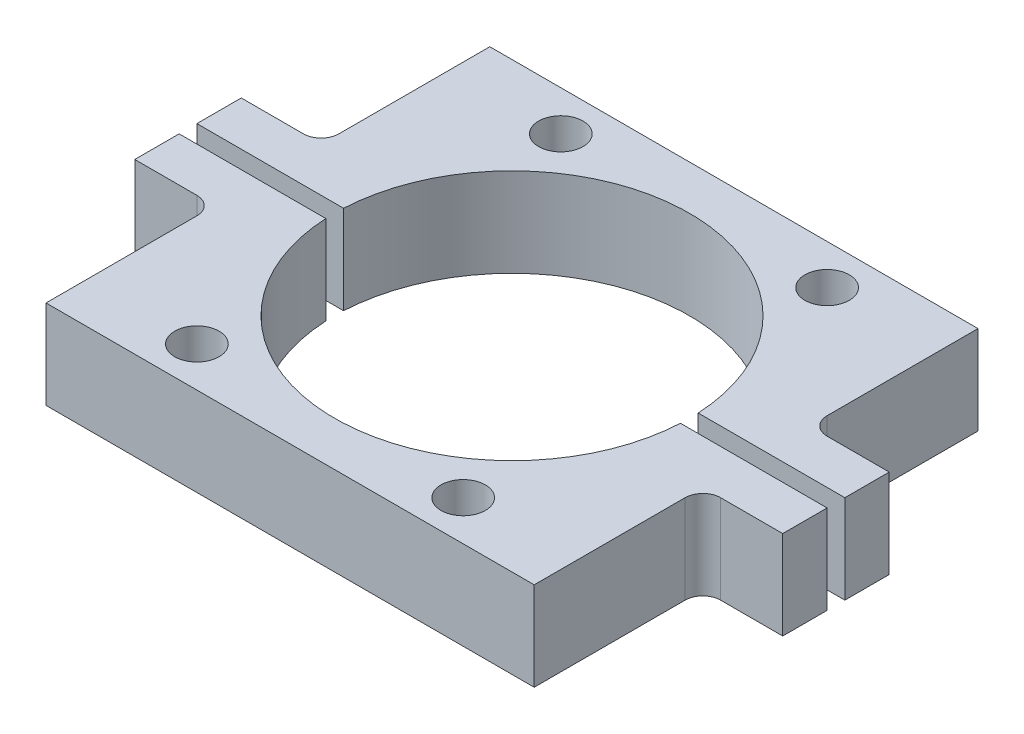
from build123d import *

# Parameters (mm, degrees)
BOSS_EXTRUDE1_DEPTH   = 20
BOSS_EXTRUDE1_2_DEPTH = 20
SKETCH2_R             = 5
CUT_EXTRUDE2_DEPTH    = 20
FILLET1_R             = 4
FILLET2_R             = 4


with BuildPart() as part:
    # Sketch1 → Boss-Extrude1 (new body)
    with BuildSketch(Plane(origin=(0, 0, 0), x_dir=(1, 0, 0), z_dir=(0, 1, 0))):
        with BuildLine():
            Line((-73, -2), (-73, -12))
            Line((-73, -12), (-55, -12))
            Line((-55, -12), (-55, -50))
            Line((-55, -50), (55, -50))
            Line((55, -50), (55, -12))
            Line((55, -12), (73, -12))
            Line((73, -12), (73, -2))
            Line((73, -2), (39.949968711, -2))
            ThreePointArc((39.949968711, -2), (0, -40), (-39.949968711, -2))
            Line((-39.949968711, -2), (-73, -2))
        make_face()
    extrude(amount=BOSS_EXTRUDE1_DEPTH)


with BuildPart() as body_2:
    # Sketch1 → Boss-Extrude1 2 (new body)
    with BuildSketch(Plane(origin=(0, 0, 0), x_dir=(1, 0, 0), z_dir=(0, 1, 0))):
        with BuildLine():
            Line((55, 50), (-55, 50))
            Line((-55, 50), (-55, 12))
            Line((-55, 12), (-73, 12))
            Line((-73, 12), (-73, 2))
            Line((-73, 2), (-39.949968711, 2))
            ThreePointArc((-39.949968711, 2), (0, 40), (39.949968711, 2))
            Line((39.949968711, 2), (73, 2))
            Line((73, 2), (73, 12))
            Line((73, 12), (55, 12))
            Line((55, 12), (55, 50))
        make_face()
    extrude(amount=BOSS_EXTRUDE1_2_DEPTH)


with BuildPart() as cut_extrude2_tool:
    # Sketch2 → Cut-Extrude2 (new body)
    with BuildSketch(Plane(origin=(0, 0, 0), x_dir=(1, 0, 0), z_dir=(0, 1, 0))):
        with Locations(Location((30, 41, 0), (0, 0, 270))):
            Circle(SKETCH2_R)
        with Locations(Location((-30, -41, 0), (0, 0, 270))):
            Circle(SKETCH2_R)
        with Locations(Location((-30, 41, 0), (0, 0, 270))):
            Circle(SKETCH2_R)
        with Locations(Location((30, -41, 0), (0, 0, 270))):
            Circle(SKETCH2_R)
    extrude(amount=CUT_EXTRUDE2_DEPTH)


with BuildPart() as part_1:
    add(part.part)

    # Cut-Extrude2: cut by cut_extrude2_tool
    add(cut_extrude2_tool.part, mode=Mode.SUBTRACT)

    # Fillet2
    fillet2_edges = [part_1.edges().sort_by_distance(p)[0] for p in [
        (55, 10, 12),
        (-55, 10, 12),
    ]]
    fillet(fillet2_edges, radius=FILLET2_R)


with BuildPart() as body_2_1:
    add(body_2.part)

    # Cut-Extrude2: cut by cut_extrude2_tool
    add(cut_extrude2_tool.part, mode=Mode.SUBTRACT)

    # Fillet1
    fillet1_edges = [body_2_1.edges().sort_by_distance(p)[0] for p in [
        (55, 10, -12),
        (-55, 10, -12),
    ]]
    fillet(fillet1_edges, radius=FILLET1_R)


solid = Compound([part_1.part, body_2_1.part])
